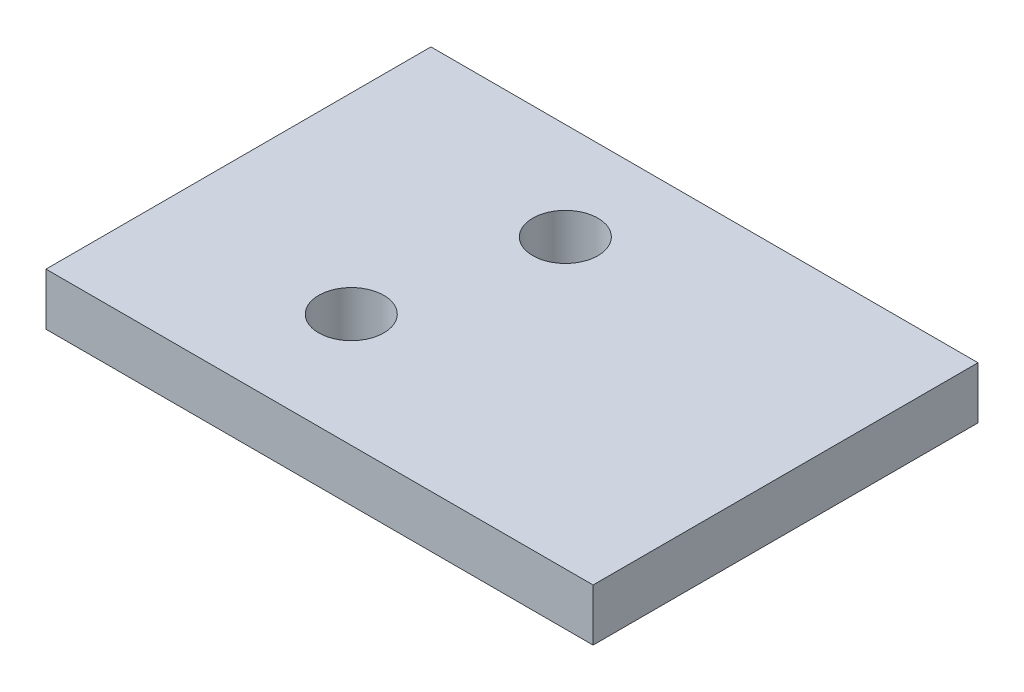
from build123d import *

# Parameters (mm, degrees)
SKETCH1_W          = 2133.6
SKETCH1_H          = 1501.14
EXTRUDE1_DEPTH     = 203.2
SKETCH2_R          = 127
CUT_EXTRUDE1_DEPTH = 2617.669734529


with BuildPart() as part:
    # Sketch1 → Extrude1 (new body)
    with BuildSketch(Plane(origin=(0, 0, 0), x_dir=(1, 0, 0), z_dir=(0, 1, 0))):
        with Locations((1066.8, 750.57)):
            Rectangle(SKETCH1_W, SKETCH1_H)
    extrude(amount=EXTRUDE1_DEPTH)

    # Sketch2 → Cut-Extrude1 (cut, through all)
    with BuildSketch(Plane(origin=(0, 203.2, 0), x_dir=(1, 0, 0), z_dir=(0, 1, 0))):
        with Locations(Location((904, 1121.4, 0), (0, 0, 270))):
            Circle(SKETCH2_R)
        with Locations(Location((747.3, 443.2, 0), (0, 0, 270))):
            Circle(SKETCH2_R)
    extrude(amount=-CUT_EXTRUDE1_DEPTH, mode=Mode.SUBTRACT)


solid = part.part
